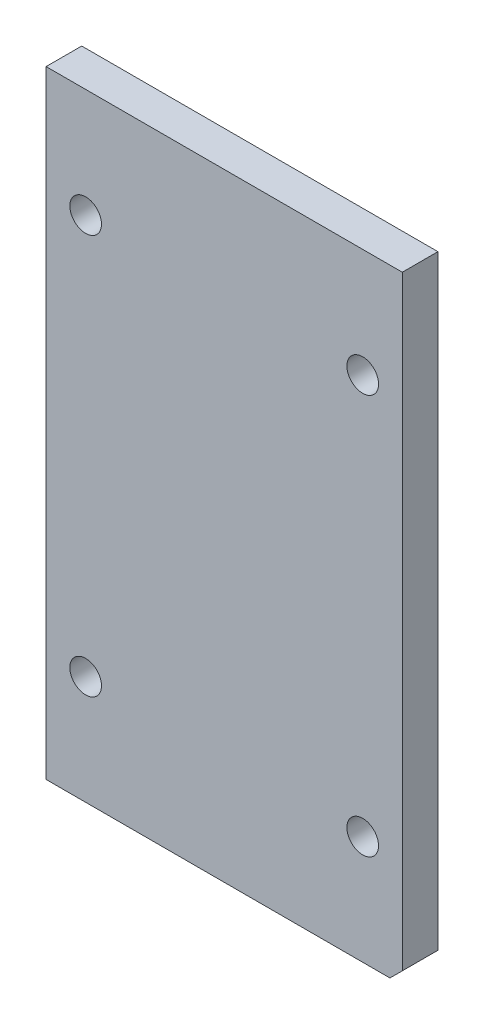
ISO-10303-21;
HEADER;
FILE_DESCRIPTION(('STEP AP214'),'2;1');
FILE_NAME('part.step','',(''),(''),'','','');
FILE_SCHEMA(('AUTOMOTIVE_DESIGN { 1 0 10303 214 1 1 1 1 }'));
ENDSEC;
DATA;
#1=APPLICATION_CONTEXT('core data for automotive mechanical design processes');
#2=APPLICATION_PROTOCOL_DEFINITION('international standard','automotive_design',2000,#1);
#3=PRODUCT_CONTEXT('',#1,'mechanical');
#4=PRODUCT('Part','Part','',(#3));
#5=PRODUCT_RELATED_PRODUCT_CATEGORY('part','',(#4));
#6=PRODUCT_DEFINITION_FORMATION('','',#4);
#7=PRODUCT_DEFINITION_CONTEXT('part definition',#1,'design');
#8=PRODUCT_DEFINITION('design','',#6,#7);
#9=PRODUCT_DEFINITION_SHAPE('','',#8);
#10=(LENGTH_UNIT() NAMED_UNIT(*) SI_UNIT(.MILLI.,.METRE.));
#11=(NAMED_UNIT(*) PLANE_ANGLE_UNIT() SI_UNIT($,.RADIAN.));
#12=(NAMED_UNIT(*) SI_UNIT($,.STERADIAN.) SOLID_ANGLE_UNIT());
#13=UNCERTAINTY_MEASURE_WITH_UNIT(LENGTH_MEASURE(1.E-05),#10,'distance_accuracy_value','');
#14=(GEOMETRIC_REPRESENTATION_CONTEXT(3) GLOBAL_UNCERTAINTY_ASSIGNED_CONTEXT((#13)) GLOBAL_UNIT_ASSIGNED_CONTEXT((#10,
#11,#12)) REPRESENTATION_CONTEXT('',''));
#15=CARTESIAN_POINT('',(0.,0.,0.));
#16=DIRECTION('',(0.,0.,1.));
#17=DIRECTION('',(1.,0.,0.));
#18=AXIS2_PLACEMENT_3D('',#15,#16,#17);
#19=CARTESIAN_POINT('',(-45.,78.,-189.099972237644));
#20=DIRECTION('',(0.,1.,0.));
#21=DIRECTION('',(0.,0.,1.));
#22=AXIS2_PLACEMENT_3D('',#19,#20,#21);
#23=PLANE('',#22);
#24=DIRECTION('',(1.,0.,0.));
#25=VECTOR('',#24,1.);
#26=CARTESIAN_POINT('',(-45.,78.,-9.00000000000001));
#27=LINE('',#26,#25);
#28=CARTESIAN_POINT('',(-45.,78.,-9.00000000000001));
#29=VERTEX_POINT('',#28);
#30=CARTESIAN_POINT('',(45.,78.,-9.00000000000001));
#31=VERTEX_POINT('',#30);
#32=EDGE_CURVE('E86',#29,#31,#27,.T.);
#33=ORIENTED_EDGE('',*,*,#32,.F.);
#34=DIRECTION('',(0.,0.,1.));
#35=VECTOR('',#34,1.);
#36=CARTESIAN_POINT('',(-45.,78.,-189.099972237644));
#37=LINE('',#36,#35);
#38=CARTESIAN_POINT('',(-45.,78.,0.));
#39=VERTEX_POINT('',#38);
#40=EDGE_CURVE('E81',#29,#39,#37,.T.);
#41=ORIENTED_EDGE('',*,*,#40,.T.);
#42=DIRECTION('',(-1.,0.,0.));
#43=VECTOR('',#42,1.);
#44=CARTESIAN_POINT('',(-45.,78.,0.));
#45=LINE('',#44,#43);
#46=CARTESIAN_POINT('',(45.,78.,0.));
#47=VERTEX_POINT('',#46);
#48=EDGE_CURVE('E85',#47,#39,#45,.T.);
#49=ORIENTED_EDGE('',*,*,#48,.F.);
#50=DIRECTION('',(0.,0.,1.));
#51=VECTOR('',#50,1.);
#52=CARTESIAN_POINT('',(45.,78.,-189.099972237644));
#53=LINE('',#52,#51);
#54=EDGE_CURVE('E111',#31,#47,#53,.T.);
#55=ORIENTED_EDGE('',*,*,#54,.F.);
#56=EDGE_LOOP('',(#33,#41,#49,#55));
#57=FACE_BOUND('',#56,.T.);
#58=ADVANCED_FACE('F34',(#57),#23,.T.);
#59=CARTESIAN_POINT('',(45.,78.,-189.099972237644));
#60=DIRECTION('',(1.,0.,0.));
#61=DIRECTION('',(0.,1.,0.));
#62=AXIS2_PLACEMENT_3D('',#59,#60,#61);
#63=PLANE('',#62);
#64=DIRECTION('',(0.,1.,0.));
#65=VECTOR('',#64,1.);
#66=CARTESIAN_POINT('',(45.,78.,0.));
#67=LINE('',#66,#65);
#68=CARTESIAN_POINT('',(45.,-74.88,0.));
#69=VERTEX_POINT('',#68);
#70=EDGE_CURVE('E90',#69,#47,#67,.T.);
#71=ORIENTED_EDGE('',*,*,#70,.F.);
#72=DIRECTION('',(0.,0.,-1.));
#73=VECTOR('',#72,1.);
#74=CARTESIAN_POINT('',(45.,-74.88,-189.099972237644));
#75=LINE('',#74,#73);
#76=CARTESIAN_POINT('',(45.,-74.88,-9.00000000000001));
#77=VERTEX_POINT('',#76);
#78=EDGE_CURVE('E42',#69,#77,#75,.T.);
#79=ORIENTED_EDGE('',*,*,#78,.T.);
#80=DIRECTION('',(0.,-1.,0.));
#81=VECTOR('',#80,1.);
#82=CARTESIAN_POINT('',(45.,78.,-9.00000000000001));
#83=LINE('',#82,#81);
#84=EDGE_CURVE('E143',#31,#77,#83,.T.);
#85=ORIENTED_EDGE('',*,*,#84,.F.);
#86=ORIENTED_EDGE('',*,*,#54,.T.);
#87=EDGE_LOOP('',(#71,#79,#85,#86));
#88=FACE_BOUND('',#87,.T.);
#89=ADVANCED_FACE('F205',(#88),#63,.T.);
#90=CARTESIAN_POINT('',(-45.,-78.,-189.099972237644));
#91=DIRECTION('',(0.,-1.,0.));
#92=DIRECTION('',(0.,0.,-1.));
#93=AXIS2_PLACEMENT_3D('',#90,#91,#92);
#94=PLANE('',#93);
#95=DIRECTION('',(-1.,0.,0.));
#96=VECTOR('',#95,1.);
#97=CARTESIAN_POINT('',(-45.,-78.,-9.00000000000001));
#98=LINE('',#97,#96);
#99=CARTESIAN_POINT('',(41.88,-78.,-9.00000000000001));
#100=VERTEX_POINT('',#99);
#101=CARTESIAN_POINT('',(-45.,-78.,-9.00000000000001));
#102=VERTEX_POINT('',#101);
#103=EDGE_CURVE('E113',#100,#102,#98,.T.);
#104=ORIENTED_EDGE('',*,*,#103,.F.);
#105=DIRECTION('',(0.,0.,1.));
#106=VECTOR('',#105,1.);
#107=CARTESIAN_POINT('',(41.88,-78.,-189.099972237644));
#108=LINE('',#107,#106);
#109=CARTESIAN_POINT('',(41.88,-78.,0.));
#110=VERTEX_POINT('',#109);
#111=EDGE_CURVE('E116',#100,#110,#108,.T.);
#112=ORIENTED_EDGE('',*,*,#111,.T.);
#113=DIRECTION('',(1.,0.,0.));
#114=VECTOR('',#113,1.);
#115=CARTESIAN_POINT('',(-45.,-78.,0.));
#116=LINE('',#115,#114);
#117=CARTESIAN_POINT('',(-45.,-78.,0.));
#118=VERTEX_POINT('',#117);
#119=EDGE_CURVE('E97',#118,#110,#116,.T.);
#120=ORIENTED_EDGE('',*,*,#119,.F.);
#121=DIRECTION('',(0.,0.,1.));
#122=VECTOR('',#121,1.);
#123=CARTESIAN_POINT('',(-45.,-78.,-189.099972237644));
#124=LINE('',#123,#122);
#125=EDGE_CURVE('E89',#102,#118,#124,.T.);
#126=ORIENTED_EDGE('',*,*,#125,.F.);
#127=EDGE_LOOP('',(#104,#112,#120,#126));
#128=FACE_BOUND('',#127,.T.);
#129=ADVANCED_FACE('F138',(#128),#94,.T.);
#130=CARTESIAN_POINT('',(-45.,78.,-189.099972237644));
#131=DIRECTION('',(-1.,0.,0.));
#132=DIRECTION('',(0.,-1.,0.));
#133=AXIS2_PLACEMENT_3D('',#130,#131,#132);
#134=PLANE('',#133);
#135=DIRECTION('',(0.,1.,0.));
#136=VECTOR('',#135,1.);
#137=CARTESIAN_POINT('',(-45.,78.,-9.00000000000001));
#138=LINE('',#137,#136);
#139=EDGE_CURVE('E115',#102,#29,#138,.T.);
#140=ORIENTED_EDGE('',*,*,#139,.F.);
#141=ORIENTED_EDGE('',*,*,#125,.T.);
#142=DIRECTION('',(0.,-1.,0.));
#143=VECTOR('',#142,1.);
#144=CARTESIAN_POINT('',(-45.,78.,0.));
#145=LINE('',#144,#143);
#146=EDGE_CURVE('E93',#39,#118,#145,.T.);
#147=ORIENTED_EDGE('',*,*,#146,.F.);
#148=ORIENTED_EDGE('',*,*,#40,.F.);
#149=EDGE_LOOP('',(#140,#141,#147,#148));
#150=FACE_BOUND('',#149,.T.);
#151=ADVANCED_FACE('F94',(#150),#134,.T.);
#152=CARTESIAN_POINT('',(0.,0.,0.));
#153=DIRECTION('',(0.,0.,-1.));
#154=DIRECTION('',(-1.,0.,0.));
#155=AXIS2_PLACEMENT_3D('',#152,#153,#154);
#156=PLANE('',#155);
#157=CARTESIAN_POINT('',(35.,-50.5,0.));
#158=DIRECTION('',(0.,0.,1.));
#159=DIRECTION('',(1.,0.,0.));
#160=AXIS2_PLACEMENT_3D('',#157,#158,#159);
#161=CIRCLE('',#160,4.);
#162=CARTESIAN_POINT('',(39.,-50.5,0.));
#163=VERTEX_POINT('',#162);
#164=EDGE_CURVE('E172',#163,#163,#161,.T.);
#165=ORIENTED_EDGE('',*,*,#164,.F.);
#166=EDGE_LOOP('',(#165));
#167=FACE_BOUND('',#166,.T.);
#168=CARTESIAN_POINT('',(-35.,-50.5,0.));
#169=DIRECTION('',(0.,0.,1.));
#170=DIRECTION('',(1.,0.,0.));
#171=AXIS2_PLACEMENT_3D('',#168,#169,#170);
#172=CIRCLE('',#171,4.);
#173=CARTESIAN_POINT('',(-31.,-50.5,0.));
#174=VERTEX_POINT('',#173);
#175=EDGE_CURVE('E131',#174,#174,#172,.T.);
#176=ORIENTED_EDGE('',*,*,#175,.F.);
#177=EDGE_LOOP('',(#176));
#178=FACE_BOUND('',#177,.T.);
#179=CARTESIAN_POINT('',(-35.,50.5,0.));
#180=DIRECTION('',(0.,0.,1.));
#181=DIRECTION('',(1.,0.,0.));
#182=AXIS2_PLACEMENT_3D('',#179,#180,#181);
#183=CIRCLE('',#182,4.);
#184=CARTESIAN_POINT('',(-31.,50.5,0.));
#185=VERTEX_POINT('',#184);
#186=EDGE_CURVE('E126',#185,#185,#183,.T.);
#187=ORIENTED_EDGE('',*,*,#186,.F.);
#188=EDGE_LOOP('',(#187));
#189=FACE_BOUND('',#188,.T.);
#190=CARTESIAN_POINT('',(35.,50.5,0.));
#191=DIRECTION('',(0.,0.,1.));
#192=DIRECTION('',(1.,0.,0.));
#193=AXIS2_PLACEMENT_3D('',#190,#191,#192);
#194=CIRCLE('',#193,4.);
#195=CARTESIAN_POINT('',(39.,50.5,0.));
#196=VERTEX_POINT('',#195);
#197=EDGE_CURVE('E121',#196,#196,#194,.T.);
#198=ORIENTED_EDGE('',*,*,#197,.F.);
#199=EDGE_LOOP('',(#198));
#200=FACE_BOUND('',#199,.T.);
#201=ORIENTED_EDGE('',*,*,#119,.T.);
#202=DIRECTION('',(-0.70710678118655,-0.707106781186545,0.));
#203=VECTOR('',#202,1.);
#204=CARTESIAN_POINT('',(41.88,-78.,0.));
#205=LINE('',#204,#203);
#206=EDGE_CURVE('E56',#110,#69,#205,.F.);
#207=ORIENTED_EDGE('',*,*,#206,.T.);
#208=ORIENTED_EDGE('',*,*,#70,.T.);
#209=ORIENTED_EDGE('',*,*,#48,.T.);
#210=ORIENTED_EDGE('',*,*,#146,.T.);
#211=EDGE_LOOP('',(#201,#207,#208,#209,#210));
#212=FACE_BOUND('',#211,.T.);
#213=ADVANCED_FACE('F99',(#167,#178,#189,#200,#212),#156,.F.);
#214=CARTESIAN_POINT('',(0.,0.,-9.));
#215=DIRECTION('',(0.,0.,1.));
#216=DIRECTION('',(1.,0.,0.));
#217=AXIS2_PLACEMENT_3D('',#214,#215,#216);
#218=PLANE('',#217);
#219=CARTESIAN_POINT('',(35.,-50.5,-9.));
#220=DIRECTION('',(0.,0.,1.));
#221=DIRECTION('',(1.,0.,0.));
#222=AXIS2_PLACEMENT_3D('',#219,#220,#221);
#223=CIRCLE('',#222,3.4);
#224=CARTESIAN_POINT('',(38.4,-50.5,-9.));
#225=VERTEX_POINT('',#224);
#226=EDGE_CURVE('E128',#225,#225,#223,.T.);
#227=ORIENTED_EDGE('',*,*,#226,.T.);
#228=EDGE_LOOP('',(#227));
#229=FACE_BOUND('',#228,.T.);
#230=CARTESIAN_POINT('',(-35.,-50.5,-9.));
#231=DIRECTION('',(0.,0.,1.));
#232=DIRECTION('',(1.,0.,0.));
#233=AXIS2_PLACEMENT_3D('',#230,#231,#232);
#234=CIRCLE('',#233,3.4);
#235=CARTESIAN_POINT('',(-31.6,-50.5,-9.));
#236=VERTEX_POINT('',#235);
#237=EDGE_CURVE('E123',#236,#236,#234,.T.);
#238=ORIENTED_EDGE('',*,*,#237,.T.);
#239=EDGE_LOOP('',(#238));
#240=FACE_BOUND('',#239,.T.);
#241=CARTESIAN_POINT('',(-35.,50.5,-9.));
#242=DIRECTION('',(0.,0.,1.));
#243=DIRECTION('',(1.,0.,0.));
#244=AXIS2_PLACEMENT_3D('',#241,#242,#243);
#245=CIRCLE('',#244,3.4);
#246=CARTESIAN_POINT('',(-31.6,50.5,-9.));
#247=VERTEX_POINT('',#246);
#248=EDGE_CURVE('E118',#247,#247,#245,.T.);
#249=ORIENTED_EDGE('',*,*,#248,.T.);
#250=EDGE_LOOP('',(#249));
#251=FACE_BOUND('',#250,.T.);
#252=CARTESIAN_POINT('',(35.,50.5,-9.));
#253=DIRECTION('',(0.,0.,1.));
#254=DIRECTION('',(1.,0.,0.));
#255=AXIS2_PLACEMENT_3D('',#252,#253,#254);
#256=CIRCLE('',#255,3.4);
#257=CARTESIAN_POINT('',(38.4,50.5,-9.));
#258=VERTEX_POINT('',#257);
#259=EDGE_CURVE('E101',#258,#258,#256,.T.);
#260=ORIENTED_EDGE('',*,*,#259,.T.);
#261=EDGE_LOOP('',(#260));
#262=FACE_BOUND('',#261,.T.);
#263=ORIENTED_EDGE('',*,*,#84,.T.);
#264=DIRECTION('',(0.70710678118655,0.707106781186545,0.));
#265=VECTOR('',#264,1.);
#266=CARTESIAN_POINT('',(41.88,-78.,-9.00000000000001));
#267=LINE('',#266,#265);
#268=EDGE_CURVE('E11',#77,#100,#267,.F.);
#269=ORIENTED_EDGE('',*,*,#268,.T.);
#270=ORIENTED_EDGE('',*,*,#103,.T.);
#271=ORIENTED_EDGE('',*,*,#139,.T.);
#272=ORIENTED_EDGE('',*,*,#32,.T.);
#273=EDGE_LOOP('',(#263,#269,#270,#271,#272));
#274=FACE_BOUND('',#273,.T.);
#275=ADVANCED_FACE('F142',(#229,#240,#251,#262,#274),#218,.F.);
#276=CARTESIAN_POINT('',(35.,50.5,0.));
#277=DIRECTION('',(0.,0.,1.));
#278=DIRECTION('',(1.,0.,0.));
#279=AXIS2_PLACEMENT_3D('',#276,#277,#278);
#280=CYLINDRICAL_SURFACE('',#279,3.4);
#281=CARTESIAN_POINT('',(35.,50.5,-8.9));
#282=DIRECTION('',(0.,0.,1.));
#283=DIRECTION('',(1.,0.,0.));
#284=AXIS2_PLACEMENT_3D('',#281,#282,#283);
#285=CIRCLE('',#284,3.4);
#286=CARTESIAN_POINT('',(38.4,50.5,-8.9));
#287=VERTEX_POINT('',#286);
#288=EDGE_CURVE('E104',#287,#287,#285,.T.);
#289=ORIENTED_EDGE('',*,*,#288,.T.);
#290=EDGE_LOOP('',(#289));
#291=FACE_BOUND('',#290,.T.);
#292=ORIENTED_EDGE('',*,*,#259,.F.);
#293=EDGE_LOOP('',(#292));
#294=FACE_BOUND('',#293,.T.);
#295=ADVANCED_FACE('F200',(#291,#294),#280,.F.);
#296=CARTESIAN_POINT('',(38.4,50.5,-8.9));
#297=DIRECTION('',(0.,0.,-1.));
#298=DIRECTION('',(-1.,0.,0.));
#299=AXIS2_PLACEMENT_3D('',#296,#297,#298);
#300=PLANE('',#299);
#301=ORIENTED_EDGE('',*,*,#288,.F.);
#302=EDGE_LOOP('',(#301));
#303=FACE_BOUND('',#302,.T.);
#304=CARTESIAN_POINT('',(35.,50.5,-8.9));
#305=DIRECTION('',(0.,0.,1.));
#306=DIRECTION('',(1.,0.,0.));
#307=AXIS2_PLACEMENT_3D('',#304,#305,#306);
#308=CIRCLE('',#307,4.);
#309=CARTESIAN_POINT('',(39.,50.5,-8.9));
#310=VERTEX_POINT('',#309);
#311=EDGE_CURVE('E148',#310,#310,#308,.T.);
#312=ORIENTED_EDGE('',*,*,#311,.T.);
#313=EDGE_LOOP('',(#312));
#314=FACE_BOUND('',#313,.T.);
#315=ADVANCED_FACE('F190',(#303,#314),#300,.F.);
#316=CARTESIAN_POINT('',(35.,50.5,0.));
#317=DIRECTION('',(0.,0.,1.));
#318=DIRECTION('',(1.,0.,0.));
#319=AXIS2_PLACEMENT_3D('',#316,#317,#318);
#320=CYLINDRICAL_SURFACE('',#319,4.);
#321=ORIENTED_EDGE('',*,*,#311,.F.);
#322=EDGE_LOOP('',(#321));
#323=FACE_BOUND('',#322,.T.);
#324=ORIENTED_EDGE('',*,*,#197,.T.);
#325=EDGE_LOOP('',(#324));
#326=FACE_BOUND('',#325,.T.);
#327=ADVANCED_FACE('F187',(#323,#326),#320,.F.);
#328=CARTESIAN_POINT('',(-35.,50.5,0.));
#329=DIRECTION('',(0.,0.,1.));
#330=DIRECTION('',(1.,0.,0.));
#331=AXIS2_PLACEMENT_3D('',#328,#329,#330);
#332=CYLINDRICAL_SURFACE('',#331,3.4);
#333=CARTESIAN_POINT('',(-35.,50.5,-8.9));
#334=DIRECTION('',(0.,0.,1.));
#335=DIRECTION('',(1.,0.,0.));
#336=AXIS2_PLACEMENT_3D('',#333,#334,#335);
#337=CIRCLE('',#336,3.4);
#338=CARTESIAN_POINT('',(-31.6,50.5,-8.9));
#339=VERTEX_POINT('',#338);
#340=EDGE_CURVE('E122',#339,#339,#337,.T.);
#341=ORIENTED_EDGE('',*,*,#340,.T.);
#342=EDGE_LOOP('',(#341));
#343=FACE_BOUND('',#342,.T.);
#344=ORIENTED_EDGE('',*,*,#248,.F.);
#345=EDGE_LOOP('',(#344));
#346=FACE_BOUND('',#345,.T.);
#347=ADVANCED_FACE('F189',(#343,#346),#332,.F.);
#348=CARTESIAN_POINT('',(-31.6,50.5,-8.9));
#349=DIRECTION('',(0.,0.,-1.));
#350=DIRECTION('',(-1.,0.,0.));
#351=AXIS2_PLACEMENT_3D('',#348,#349,#350);
#352=PLANE('',#351);
#353=ORIENTED_EDGE('',*,*,#340,.F.);
#354=EDGE_LOOP('',(#353));
#355=FACE_BOUND('',#354,.T.);
#356=CARTESIAN_POINT('',(-35.,50.5,-8.9));
#357=DIRECTION('',(0.,0.,1.));
#358=DIRECTION('',(1.,0.,0.));
#359=AXIS2_PLACEMENT_3D('',#356,#357,#358);
#360=CIRCLE('',#359,4.);
#361=CARTESIAN_POINT('',(-31.,50.5,-8.9));
#362=VERTEX_POINT('',#361);
#363=EDGE_CURVE('E155',#362,#362,#360,.T.);
#364=ORIENTED_EDGE('',*,*,#363,.T.);
#365=EDGE_LOOP('',(#364));
#366=FACE_BOUND('',#365,.T.);
#367=ADVANCED_FACE('F197',(#355,#366),#352,.F.);
#368=CARTESIAN_POINT('',(-35.,50.5,0.));
#369=DIRECTION('',(0.,0.,1.));
#370=DIRECTION('',(1.,0.,0.));
#371=AXIS2_PLACEMENT_3D('',#368,#369,#370);
#372=CYLINDRICAL_SURFACE('',#371,4.);
#373=ORIENTED_EDGE('',*,*,#363,.F.);
#374=EDGE_LOOP('',(#373));
#375=FACE_BOUND('',#374,.T.);
#376=ORIENTED_EDGE('',*,*,#186,.T.);
#377=EDGE_LOOP('',(#376));
#378=FACE_BOUND('',#377,.T.);
#379=ADVANCED_FACE('F253',(#375,#378),#372,.F.);
#380=CARTESIAN_POINT('',(-35.,-50.5,0.));
#381=DIRECTION('',(0.,0.,1.));
#382=DIRECTION('',(1.,0.,0.));
#383=AXIS2_PLACEMENT_3D('',#380,#381,#382);
#384=CYLINDRICAL_SURFACE('',#383,3.4);
#385=CARTESIAN_POINT('',(-35.,-50.5,-8.9));
#386=DIRECTION('',(0.,0.,1.));
#387=DIRECTION('',(1.,0.,0.));
#388=AXIS2_PLACEMENT_3D('',#385,#386,#387);
#389=CIRCLE('',#388,3.4);
#390=CARTESIAN_POINT('',(-31.6,-50.5,-8.9));
#391=VERTEX_POINT('',#390);
#392=EDGE_CURVE('E127',#391,#391,#389,.T.);
#393=ORIENTED_EDGE('',*,*,#392,.T.);
#394=EDGE_LOOP('',(#393));
#395=FACE_BOUND('',#394,.T.);
#396=ORIENTED_EDGE('',*,*,#237,.F.);
#397=EDGE_LOOP('',(#396));
#398=FACE_BOUND('',#397,.T.);
#399=ADVANCED_FACE('F263',(#395,#398),#384,.F.);
#400=CARTESIAN_POINT('',(-31.6,-50.5,-8.9));
#401=DIRECTION('',(0.,0.,-1.));
#402=DIRECTION('',(-1.,0.,0.));
#403=AXIS2_PLACEMENT_3D('',#400,#401,#402);
#404=PLANE('',#403);
#405=ORIENTED_EDGE('',*,*,#392,.F.);
#406=EDGE_LOOP('',(#405));
#407=FACE_BOUND('',#406,.T.);
#408=CARTESIAN_POINT('',(-35.,-50.5,-8.9));
#409=DIRECTION('',(0.,0.,1.));
#410=DIRECTION('',(1.,0.,0.));
#411=AXIS2_PLACEMENT_3D('',#408,#409,#410);
#412=CIRCLE('',#411,4.);
#413=CARTESIAN_POINT('',(-31.,-50.5,-8.9));
#414=VERTEX_POINT('',#413);
#415=EDGE_CURVE('E162',#414,#414,#412,.T.);
#416=ORIENTED_EDGE('',*,*,#415,.T.);
#417=EDGE_LOOP('',(#416));
#418=FACE_BOUND('',#417,.T.);
#419=ADVANCED_FACE('F273',(#407,#418),#404,.F.);
#420=CARTESIAN_POINT('',(-35.,-50.5,0.));
#421=DIRECTION('',(0.,0.,1.));
#422=DIRECTION('',(1.,0.,0.));
#423=AXIS2_PLACEMENT_3D('',#420,#421,#422);
#424=CYLINDRICAL_SURFACE('',#423,4.);
#425=ORIENTED_EDGE('',*,*,#415,.F.);
#426=EDGE_LOOP('',(#425));
#427=FACE_BOUND('',#426,.T.);
#428=ORIENTED_EDGE('',*,*,#175,.T.);
#429=EDGE_LOOP('',(#428));
#430=FACE_BOUND('',#429,.T.);
#431=ADVANCED_FACE('F283',(#427,#430),#424,.F.);
#432=CARTESIAN_POINT('',(35.,-50.5,0.));
#433=DIRECTION('',(0.,0.,1.));
#434=DIRECTION('',(1.,0.,0.));
#435=AXIS2_PLACEMENT_3D('',#432,#433,#434);
#436=CYLINDRICAL_SURFACE('',#435,3.4);
#437=CARTESIAN_POINT('',(35.,-50.5,-8.9));
#438=DIRECTION('',(0.,0.,1.));
#439=DIRECTION('',(1.,0.,0.));
#440=AXIS2_PLACEMENT_3D('',#437,#438,#439);
#441=CIRCLE('',#440,3.4);
#442=CARTESIAN_POINT('',(38.4,-50.5,-8.9));
#443=VERTEX_POINT('',#442);
#444=EDGE_CURVE('E132',#443,#443,#441,.T.);
#445=ORIENTED_EDGE('',*,*,#444,.T.);
#446=EDGE_LOOP('',(#445));
#447=FACE_BOUND('',#446,.T.);
#448=ORIENTED_EDGE('',*,*,#226,.F.);
#449=EDGE_LOOP('',(#448));
#450=FACE_BOUND('',#449,.T.);
#451=ADVANCED_FACE('F293',(#447,#450),#436,.F.);
#452=CARTESIAN_POINT('',(38.4,-50.5,-8.9));
#453=DIRECTION('',(0.,0.,-1.));
#454=DIRECTION('',(-1.,0.,0.));
#455=AXIS2_PLACEMENT_3D('',#452,#453,#454);
#456=PLANE('',#455);
#457=ORIENTED_EDGE('',*,*,#444,.F.);
#458=EDGE_LOOP('',(#457));
#459=FACE_BOUND('',#458,.T.);
#460=CARTESIAN_POINT('',(35.,-50.5,-8.9));
#461=DIRECTION('',(0.,0.,1.));
#462=DIRECTION('',(1.,0.,0.));
#463=AXIS2_PLACEMENT_3D('',#460,#461,#462);
#464=CIRCLE('',#463,4.);
#465=CARTESIAN_POINT('',(39.,-50.5,-8.9));
#466=VERTEX_POINT('',#465);
#467=EDGE_CURVE('E169',#466,#466,#464,.T.);
#468=ORIENTED_EDGE('',*,*,#467,.T.);
#469=EDGE_LOOP('',(#468));
#470=FACE_BOUND('',#469,.T.);
#471=ADVANCED_FACE('F303',(#459,#470),#456,.F.);
#472=CARTESIAN_POINT('',(35.,-50.5,0.));
#473=DIRECTION('',(0.,0.,1.));
#474=DIRECTION('',(1.,0.,0.));
#475=AXIS2_PLACEMENT_3D('',#472,#473,#474);
#476=CYLINDRICAL_SURFACE('',#475,4.);
#477=ORIENTED_EDGE('',*,*,#467,.F.);
#478=EDGE_LOOP('',(#477));
#479=FACE_BOUND('',#478,.T.);
#480=ORIENTED_EDGE('',*,*,#164,.T.);
#481=EDGE_LOOP('',(#480));
#482=FACE_BOUND('',#481,.T.);
#483=ADVANCED_FACE('F176',(#479,#482),#476,.F.);
#484=CARTESIAN_POINT('',(41.88,-78.,-189.099972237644));
#485=DIRECTION('',(-0.707106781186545,0.70710678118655,0.));
#486=DIRECTION('',(0.,0.,1.));
#487=AXIS2_PLACEMENT_3D('',#484,#485,#486);
#488=PLANE('',#487);
#489=ORIENTED_EDGE('',*,*,#268,.F.);
#490=ORIENTED_EDGE('',*,*,#78,.F.);
#491=ORIENTED_EDGE('',*,*,#206,.F.);
#492=ORIENTED_EDGE('',*,*,#111,.F.);
#493=EDGE_LOOP('',(#489,#490,#491,#492));
#494=FACE_BOUND('',#493,.T.);
#495=ADVANCED_FACE('F36',(#494),#488,.F.);
#496=CLOSED_SHELL('',(#58,#89,#129,#151,#213,#275,#295,#315,#327,#347,#367,#379,#399,#419,#431,
#451,#471,#483,#495));
#497=MANIFOLD_SOLID_BREP('B2',#496);
#498=ADVANCED_BREP_SHAPE_REPRESENTATION('',(#18,#497),#14);
#499=SHAPE_DEFINITION_REPRESENTATION(#9,#498);
ENDSEC;
END-ISO-10303-21;
